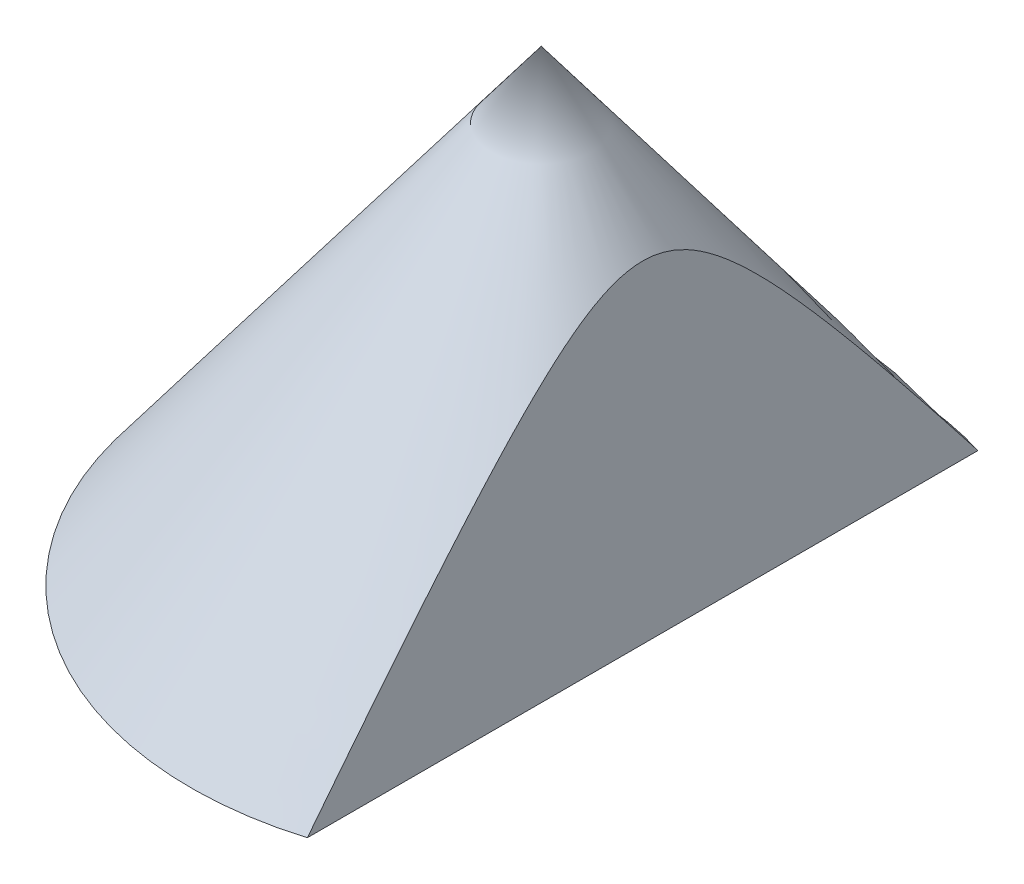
from build123d import *

# Parameters (mm, degrees)
CUT_EXTRUDE_1_DEPTH      = 126.841873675
CUT_EXTRUDE_1_DEPTH_BACK = 126.841873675


with BuildPart() as part:
    # Sketch 1 → Revolve 1 (revolve)
    with BuildSketch(Plane(origin=(0, 0, 0), x_dir=(0, 0, -1), z_dir=(1, 0, 0))):
        Polygon((0, 12.931034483), (60, 12.931034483), (0, 92.931034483), align=None)
    revolve(axis=Axis((0, 0, 0), (0, 1, 0)))

    # Sketch 2 → Cut-Extrude 1 (cut, two sides: drawn at the far end of the back side and taken through both)
    with BuildSketch(Plane.XY.offset(-CUT_EXTRUDE_1_DEPTH_BACK)):
        Polygon((17.371464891, 69.769081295), (17.371464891, 12.931034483), (66.454406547, 8.204376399), (68.055360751, 94.255664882), align=None)
    extrude(amount=CUT_EXTRUDE_1_DEPTH + CUT_EXTRUDE_1_DEPTH_BACK, mode=Mode.SUBTRACT)


solid = part.part
